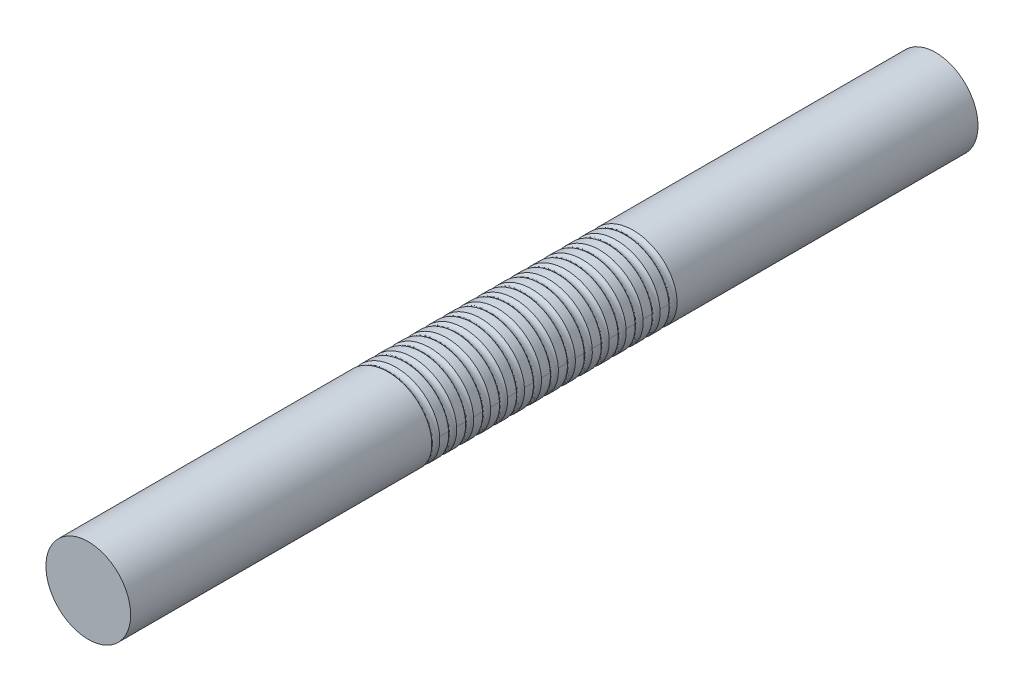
from build123d import *

# Parameters (mm, degrees)
SKETCH1_R              = 25
BOSS_EXTRUDE1_DEPTH    = 500
CUT_SWEEP1_PITCH       = 10
CUT_SWEEP1_HEIGHT      = 150
CUT_SWEEP1_RADIUS      = 27.116666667
CUT_SWEEP1_START_ANGLE = -180
SKETCH3_R              = 3.175


with BuildPart() as part:
    # Sketch1 → Boss-Extrude1 (new body)
    with BuildSketch(Plane.XY):
        Circle(SKETCH1_R)
    extrude(amount=BOSS_EXTRUDE1_DEPTH)

    # Cut-Sweep1: sweep along a helix
    with BuildLine() as cut_sweep1_path:
        add(Helix(CUT_SWEEP1_PITCH, CUT_SWEEP1_HEIGHT, CUT_SWEEP1_RADIUS, center=(0, 0, 175), direction=(0, 0, 1), mode=Mode.PRIVATE).rotate(Axis((0, 0, 175), (0, 0, 1)), CUT_SWEEP1_START_ANGLE))
    # Sketch3 → Cut-Sweep1 (sweep, cut)
    with BuildSketch(Plane(origin=(0, 0, 0), x_dir=(1, 0, 0), z_dir=(0, 1, 0))):
        with Locations((-27.116666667, -175)):
            Circle(SKETCH3_R)
    sweep(path=cut_sweep1_path.line, is_frenet=True, mode=Mode.SUBTRACT)


solid = part.part
